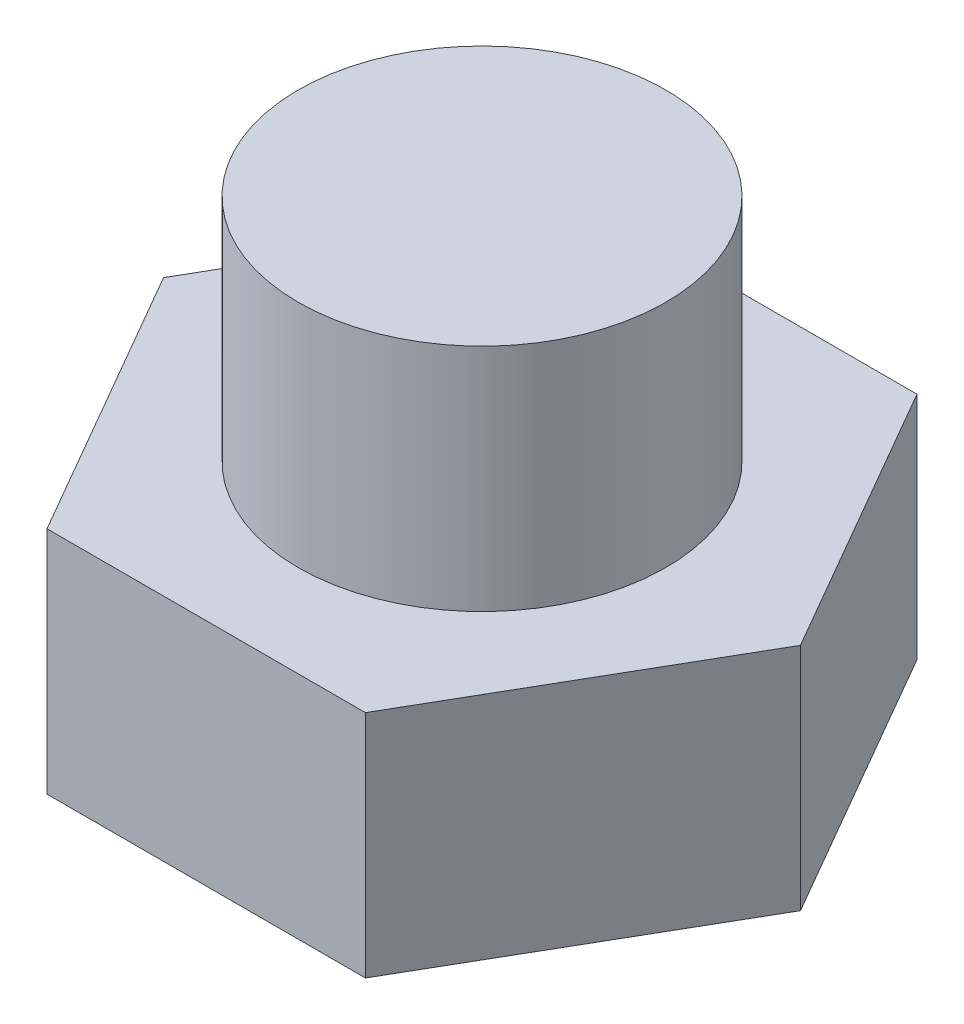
ISO-10303-21;
HEADER;
FILE_DESCRIPTION(('STEP AP214'),'2;1');
FILE_NAME('part.step','',(''),(''),'','','');
FILE_SCHEMA(('AUTOMOTIVE_DESIGN { 1 0 10303 214 1 1 1 1 }'));
ENDSEC;
DATA;
#1=APPLICATION_CONTEXT('core data for automotive mechanical design processes');
#2=APPLICATION_PROTOCOL_DEFINITION('international standard','automotive_design',2000,#1);
#3=PRODUCT_CONTEXT('',#1,'mechanical');
#4=PRODUCT('Part','Part','',(#3));
#5=PRODUCT_RELATED_PRODUCT_CATEGORY('part','',(#4));
#6=PRODUCT_DEFINITION_FORMATION('','',#4);
#7=PRODUCT_DEFINITION_CONTEXT('part definition',#1,'design');
#8=PRODUCT_DEFINITION('design','',#6,#7);
#9=PRODUCT_DEFINITION_SHAPE('','',#8);
#10=(LENGTH_UNIT() NAMED_UNIT(*) SI_UNIT(.MILLI.,.METRE.));
#11=(NAMED_UNIT(*) PLANE_ANGLE_UNIT() SI_UNIT($,.RADIAN.));
#12=(NAMED_UNIT(*) SI_UNIT($,.STERADIAN.) SOLID_ANGLE_UNIT());
#13=UNCERTAINTY_MEASURE_WITH_UNIT(LENGTH_MEASURE(1.E-05),#10,'distance_accuracy_value','');
#14=(GEOMETRIC_REPRESENTATION_CONTEXT(3) GLOBAL_UNCERTAINTY_ASSIGNED_CONTEXT((#13)) GLOBAL_UNIT_ASSIGNED_CONTEXT((#10,
#11,#12)) REPRESENTATION_CONTEXT('',''));
#15=CARTESIAN_POINT('',(0.,0.,0.));
#16=DIRECTION('',(0.,0.,1.));
#17=DIRECTION('',(1.,0.,0.));
#18=AXIS2_PLACEMENT_3D('',#15,#16,#17);
#19=CARTESIAN_POINT('',(13.856406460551,10.,0.));
#20=DIRECTION('',(-0.866025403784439,0.,0.5));
#21=DIRECTION('',(0.5,0.,0.866025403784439));
#22=AXIS2_PLACEMENT_3D('',#19,#20,#21);
#23=PLANE('',#22);
#24=DIRECTION('',(-0.5,0.,-0.866025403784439));
#25=VECTOR('',#24,1.);
#26=CARTESIAN_POINT('',(13.856406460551,0.,0.));
#27=LINE('',#26,#25);
#28=CARTESIAN_POINT('',(13.856406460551,0.,0.));
#29=VERTEX_POINT('',#28);
#30=CARTESIAN_POINT('',(6.92820323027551,0.,-12.));
#31=VERTEX_POINT('',#30);
#32=EDGE_CURVE('E136',#29,#31,#27,.T.);
#33=ORIENTED_EDGE('',*,*,#32,.T.);
#34=DIRECTION('',(0.,-1.,0.));
#35=VECTOR('',#34,1.);
#36=CARTESIAN_POINT('',(6.92820323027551,10.,-12.));
#37=LINE('',#36,#35);
#38=CARTESIAN_POINT('',(6.92820323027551,10.,-12.));
#39=VERTEX_POINT('',#38);
#40=EDGE_CURVE('E48',#39,#31,#37,.T.);
#41=ORIENTED_EDGE('',*,*,#40,.F.);
#42=DIRECTION('',(-0.5,0.,-0.866025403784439));
#43=VECTOR('',#42,1.);
#44=CARTESIAN_POINT('',(13.856406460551,10.,0.));
#45=LINE('',#44,#43);
#46=CARTESIAN_POINT('',(13.856406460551,10.,0.));
#47=VERTEX_POINT('',#46);
#48=EDGE_CURVE('E153',#47,#39,#45,.T.);
#49=ORIENTED_EDGE('',*,*,#48,.F.);
#50=DIRECTION('',(0.,-1.,0.));
#51=VECTOR('',#50,1.);
#52=CARTESIAN_POINT('',(13.856406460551,10.,0.));
#53=LINE('',#52,#51);
#54=EDGE_CURVE('E132',#47,#29,#53,.T.);
#55=ORIENTED_EDGE('',*,*,#54,.T.);
#56=EDGE_LOOP('',(#33,#41,#49,#55));
#57=FACE_BOUND('',#56,.T.);
#58=ADVANCED_FACE('F45',(#57),#23,.F.);
#59=CARTESIAN_POINT('',(6.92820323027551,10.,-12.));
#60=DIRECTION('',(0.,0.,1.));
#61=DIRECTION('',(1.,0.,0.));
#62=AXIS2_PLACEMENT_3D('',#59,#60,#61);
#63=PLANE('',#62);
#64=DIRECTION('',(-1.,0.,0.));
#65=VECTOR('',#64,1.);
#66=CARTESIAN_POINT('',(6.92820323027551,0.,-12.));
#67=LINE('',#66,#65);
#68=CARTESIAN_POINT('',(-6.9282032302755,0.,-12.));
#69=VERTEX_POINT('',#68);
#70=EDGE_CURVE('E140',#31,#69,#67,.T.);
#71=ORIENTED_EDGE('',*,*,#70,.T.);
#72=DIRECTION('',(0.,-1.,0.));
#73=VECTOR('',#72,1.);
#74=CARTESIAN_POINT('',(-6.9282032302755,10.,-12.));
#75=LINE('',#74,#73);
#76=CARTESIAN_POINT('',(-6.9282032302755,10.,-12.));
#77=VERTEX_POINT('',#76);
#78=EDGE_CURVE('E159',#77,#69,#75,.T.);
#79=ORIENTED_EDGE('',*,*,#78,.F.);
#80=DIRECTION('',(-1.,0.,0.));
#81=VECTOR('',#80,1.);
#82=CARTESIAN_POINT('',(6.92820323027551,10.,-12.));
#83=LINE('',#82,#81);
#84=EDGE_CURVE('E101',#39,#77,#83,.T.);
#85=ORIENTED_EDGE('',*,*,#84,.F.);
#86=ORIENTED_EDGE('',*,*,#40,.T.);
#87=EDGE_LOOP('',(#71,#79,#85,#86));
#88=FACE_BOUND('',#87,.T.);
#89=ADVANCED_FACE('F166',(#88),#63,.F.);
#90=CARTESIAN_POINT('',(-6.9282032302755,10.,-12.));
#91=DIRECTION('',(0.866025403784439,0.,0.5));
#92=DIRECTION('',(0.5,0.,-0.866025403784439));
#93=AXIS2_PLACEMENT_3D('',#90,#91,#92);
#94=PLANE('',#93);
#95=DIRECTION('',(-0.5,0.,0.866025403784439));
#96=VECTOR('',#95,1.);
#97=CARTESIAN_POINT('',(-6.9282032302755,0.,-12.));
#98=LINE('',#97,#96);
#99=CARTESIAN_POINT('',(-13.856406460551,0.,0.));
#100=VERTEX_POINT('',#99);
#101=EDGE_CURVE('E144',#69,#100,#98,.T.);
#102=ORIENTED_EDGE('',*,*,#101,.T.);
#103=DIRECTION('',(0.,-1.,0.));
#104=VECTOR('',#103,1.);
#105=CARTESIAN_POINT('',(-13.856406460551,10.,0.));
#106=LINE('',#105,#104);
#107=CARTESIAN_POINT('',(-13.856406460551,10.,0.));
#108=VERTEX_POINT('',#107);
#109=EDGE_CURVE('E125',#108,#100,#106,.T.);
#110=ORIENTED_EDGE('',*,*,#109,.F.);
#111=DIRECTION('',(-0.5,0.,0.866025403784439));
#112=VECTOR('',#111,1.);
#113=CARTESIAN_POINT('',(-6.9282032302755,10.,-12.));
#114=LINE('',#113,#112);
#115=EDGE_CURVE('E114',#77,#108,#114,.T.);
#116=ORIENTED_EDGE('',*,*,#115,.F.);
#117=ORIENTED_EDGE('',*,*,#78,.T.);
#118=EDGE_LOOP('',(#102,#110,#116,#117));
#119=FACE_BOUND('',#118,.T.);
#120=ADVANCED_FACE('F172',(#119),#94,.F.);
#121=CARTESIAN_POINT('',(-13.856406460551,10.,0.));
#122=DIRECTION('',(0.866025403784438,0.,-0.5));
#123=DIRECTION('',(-0.5,0.,-0.866025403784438));
#124=AXIS2_PLACEMENT_3D('',#121,#122,#123);
#125=PLANE('',#124);
#126=DIRECTION('',(0.5,0.,0.866025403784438));
#127=VECTOR('',#126,1.);
#128=CARTESIAN_POINT('',(-13.856406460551,0.,0.));
#129=LINE('',#128,#127);
#130=CARTESIAN_POINT('',(-6.92820323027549,0.,12.));
#131=VERTEX_POINT('',#130);
#132=EDGE_CURVE('E123',#100,#131,#129,.T.);
#133=ORIENTED_EDGE('',*,*,#132,.T.);
#134=DIRECTION('',(0.,-1.,0.));
#135=VECTOR('',#134,1.);
#136=CARTESIAN_POINT('',(-6.92820323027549,10.,12.));
#137=LINE('',#136,#135);
#138=CARTESIAN_POINT('',(-6.92820323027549,10.,12.));
#139=VERTEX_POINT('',#138);
#140=EDGE_CURVE('E120',#139,#131,#137,.T.);
#141=ORIENTED_EDGE('',*,*,#140,.F.);
#142=DIRECTION('',(0.5,0.,0.866025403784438));
#143=VECTOR('',#142,1.);
#144=CARTESIAN_POINT('',(-13.856406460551,10.,0.));
#145=LINE('',#144,#143);
#146=EDGE_CURVE('E108',#108,#139,#145,.T.);
#147=ORIENTED_EDGE('',*,*,#146,.F.);
#148=ORIENTED_EDGE('',*,*,#109,.T.);
#149=EDGE_LOOP('',(#133,#141,#147,#148));
#150=FACE_BOUND('',#149,.T.);
#151=ADVANCED_FACE('F121',(#150),#125,.F.);
#152=CARTESIAN_POINT('',(-6.92820323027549,10.,12.));
#153=DIRECTION('',(0.,0.,-1.));
#154=DIRECTION('',(-1.,0.,0.));
#155=AXIS2_PLACEMENT_3D('',#152,#153,#154);
#156=PLANE('',#155);
#157=DIRECTION('',(1.,0.,0.));
#158=VECTOR('',#157,1.);
#159=CARTESIAN_POINT('',(-6.92820323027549,0.,12.));
#160=LINE('',#159,#158);
#161=CARTESIAN_POINT('',(6.92820323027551,0.,12.));
#162=VERTEX_POINT('',#161);
#163=EDGE_CURVE('E86',#131,#162,#160,.T.);
#164=ORIENTED_EDGE('',*,*,#163,.T.);
#165=DIRECTION('',(0.,-1.,0.));
#166=VECTOR('',#165,1.);
#167=CARTESIAN_POINT('',(6.92820323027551,10.,12.));
#168=LINE('',#167,#166);
#169=CARTESIAN_POINT('',(6.92820323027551,10.,12.));
#170=VERTEX_POINT('',#169);
#171=EDGE_CURVE('E126',#170,#162,#168,.T.);
#172=ORIENTED_EDGE('',*,*,#171,.F.);
#173=DIRECTION('',(1.,0.,0.));
#174=VECTOR('',#173,1.);
#175=CARTESIAN_POINT('',(-6.92820323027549,10.,12.));
#176=LINE('',#175,#174);
#177=EDGE_CURVE('E112',#139,#170,#176,.T.);
#178=ORIENTED_EDGE('',*,*,#177,.F.);
#179=ORIENTED_EDGE('',*,*,#140,.T.);
#180=EDGE_LOOP('',(#164,#172,#178,#179));
#181=FACE_BOUND('',#180,.T.);
#182=ADVANCED_FACE('F128',(#181),#156,.F.);
#183=CARTESIAN_POINT('',(6.92820323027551,10.,12.));
#184=DIRECTION('',(-0.866025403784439,0.,-0.5));
#185=DIRECTION('',(-0.5,0.,0.866025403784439));
#186=AXIS2_PLACEMENT_3D('',#183,#184,#185);
#187=PLANE('',#186);
#188=DIRECTION('',(0.5,0.,-0.866025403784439));
#189=VECTOR('',#188,1.);
#190=CARTESIAN_POINT('',(6.92820323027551,0.,12.));
#191=LINE('',#190,#189);
#192=EDGE_CURVE('E92',#162,#29,#191,.T.);
#193=ORIENTED_EDGE('',*,*,#192,.T.);
#194=ORIENTED_EDGE('',*,*,#54,.F.);
#195=DIRECTION('',(0.5,0.,-0.866025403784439));
#196=VECTOR('',#195,1.);
#197=CARTESIAN_POINT('',(6.92820323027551,10.,12.));
#198=LINE('',#197,#196);
#199=EDGE_CURVE('E63',#170,#47,#198,.T.);
#200=ORIENTED_EDGE('',*,*,#199,.F.);
#201=ORIENTED_EDGE('',*,*,#171,.T.);
#202=EDGE_LOOP('',(#193,#194,#200,#201));
#203=FACE_BOUND('',#202,.T.);
#204=ADVANCED_FACE('F192',(#203),#187,.F.);
#205=CARTESIAN_POINT('',(0.,10.,0.));
#206=DIRECTION('',(0.,1.,0.));
#207=DIRECTION('',(0.,0.,1.));
#208=AXIS2_PLACEMENT_3D('',#205,#206,#207);
#209=PLANE('',#208);
#210=CARTESIAN_POINT('',(0.,10.,0.));
#211=DIRECTION('',(0.,1.,0.));
#212=DIRECTION('',(0.,0.,1.));
#213=AXIS2_PLACEMENT_3D('',#210,#211,#212);
#214=CIRCLE('',#213,8.);
#215=CARTESIAN_POINT('',(0.,10.,8.));
#216=VERTEX_POINT('',#215);
#217=EDGE_CURVE('E11',#216,#216,#214,.T.);
#218=ORIENTED_EDGE('',*,*,#217,.F.);
#219=EDGE_LOOP('',(#218));
#220=FACE_BOUND('',#219,.T.);
#221=ORIENTED_EDGE('',*,*,#48,.T.);
#222=ORIENTED_EDGE('',*,*,#84,.T.);
#223=ORIENTED_EDGE('',*,*,#115,.T.);
#224=ORIENTED_EDGE('',*,*,#146,.T.);
#225=ORIENTED_EDGE('',*,*,#177,.T.);
#226=ORIENTED_EDGE('',*,*,#199,.T.);
#227=EDGE_LOOP('',(#221,#222,#223,#224,#225,#226));
#228=FACE_BOUND('',#227,.T.);
#229=ADVANCED_FACE('F110',(#220,#228),#209,.T.);
#230=CARTESIAN_POINT('',(0.,0.,0.));
#231=DIRECTION('',(0.,1.,0.));
#232=DIRECTION('',(0.,0.,1.));
#233=AXIS2_PLACEMENT_3D('',#230,#231,#232);
#234=PLANE('',#233);
#235=ORIENTED_EDGE('',*,*,#32,.F.);
#236=ORIENTED_EDGE('',*,*,#192,.F.);
#237=ORIENTED_EDGE('',*,*,#163,.F.);
#238=ORIENTED_EDGE('',*,*,#132,.F.);
#239=ORIENTED_EDGE('',*,*,#101,.F.);
#240=ORIENTED_EDGE('',*,*,#70,.F.);
#241=EDGE_LOOP('',(#235,#236,#237,#238,#239,#240));
#242=FACE_BOUND('',#241,.T.);
#243=ADVANCED_FACE('F171',(#242),#234,.F.);
#244=CARTESIAN_POINT('',(0.,20.,0.));
#245=DIRECTION('',(0.,-1.,0.));
#246=DIRECTION('',(0.,0.,-1.));
#247=AXIS2_PLACEMENT_3D('',#244,#245,#246);
#248=CYLINDRICAL_SURFACE('',#247,8.);
#249=CARTESIAN_POINT('',(0.,20.,0.));
#250=DIRECTION('',(0.,1.,0.));
#251=DIRECTION('',(0.,0.,1.));
#252=AXIS2_PLACEMENT_3D('',#249,#250,#251);
#253=CIRCLE('',#252,8.);
#254=CARTESIAN_POINT('',(0.,20.,8.));
#255=VERTEX_POINT('',#254);
#256=EDGE_CURVE('E141',#255,#255,#253,.T.);
#257=ORIENTED_EDGE('',*,*,#256,.F.);
#258=EDGE_LOOP('',(#257));
#259=FACE_BOUND('',#258,.T.);
#260=ORIENTED_EDGE('',*,*,#217,.T.);
#261=EDGE_LOOP('',(#260));
#262=FACE_BOUND('',#261,.T.);
#263=ADVANCED_FACE('F185',(#259,#262),#248,.T.);
#264=CARTESIAN_POINT('',(0.,20.,0.));
#265=DIRECTION('',(0.,1.,0.));
#266=DIRECTION('',(0.,0.,1.));
#267=AXIS2_PLACEMENT_3D('',#264,#265,#266);
#268=PLANE('',#267);
#269=ORIENTED_EDGE('',*,*,#256,.T.);
#270=EDGE_LOOP('',(#269));
#271=FACE_BOUND('',#270,.T.);
#272=ADVANCED_FACE('F183',(#271),#268,.T.);
#273=CLOSED_SHELL('',(#58,#89,#120,#151,#182,#204,#229,#243,#263,#272));
#274=MANIFOLD_SOLID_BREP('B2',#273);
#275=ADVANCED_BREP_SHAPE_REPRESENTATION('',(#18,#274),#14);
#276=SHAPE_DEFINITION_REPRESENTATION(#9,#275);
ENDSEC;
END-ISO-10303-21;
